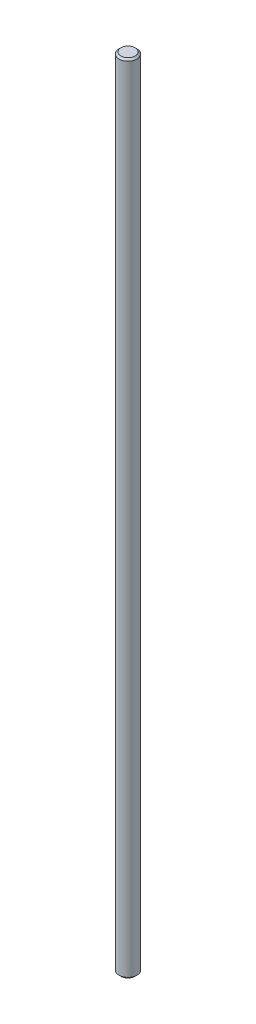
ISO-10303-21;
HEADER;
FILE_DESCRIPTION(('STEP AP214'),'2;1');
FILE_NAME('part.step','',(''),(''),'','','');
FILE_SCHEMA(('AUTOMOTIVE_DESIGN { 1 0 10303 214 1 1 1 1 }'));
ENDSEC;
DATA;
#1=APPLICATION_CONTEXT('core data for automotive mechanical design processes');
#2=APPLICATION_PROTOCOL_DEFINITION('international standard','automotive_design',2000,#1);
#3=PRODUCT_CONTEXT('',#1,'mechanical');
#4=PRODUCT('Part','Part','',(#3));
#5=PRODUCT_RELATED_PRODUCT_CATEGORY('part','',(#4));
#6=PRODUCT_DEFINITION_FORMATION('','',#4);
#7=PRODUCT_DEFINITION_CONTEXT('part definition',#1,'design');
#8=PRODUCT_DEFINITION('design','',#6,#7);
#9=PRODUCT_DEFINITION_SHAPE('','',#8);
#10=(LENGTH_UNIT() NAMED_UNIT(*) SI_UNIT(.MILLI.,.METRE.));
#11=(NAMED_UNIT(*) PLANE_ANGLE_UNIT() SI_UNIT($,.RADIAN.));
#12=(NAMED_UNIT(*) SI_UNIT($,.STERADIAN.) SOLID_ANGLE_UNIT());
#13=UNCERTAINTY_MEASURE_WITH_UNIT(LENGTH_MEASURE(1.E-05),#10,'distance_accuracy_value','');
#14=(GEOMETRIC_REPRESENTATION_CONTEXT(3) GLOBAL_UNCERTAINTY_ASSIGNED_CONTEXT((#13)) GLOBAL_UNIT_ASSIGNED_CONTEXT((#10,
#11,#12)) REPRESENTATION_CONTEXT('',''));
#15=CARTESIAN_POINT('',(0.,0.,0.));
#16=DIRECTION('',(0.,0.,1.));
#17=DIRECTION('',(1.,0.,0.));
#18=AXIS2_PLACEMENT_3D('',#15,#16,#17);
#19=CARTESIAN_POINT('',(0.,178.,0.));
#20=DIRECTION('',(0.,-1.,0.));
#21=DIRECTION('',(0.,0.,-1.));
#22=AXIS2_PLACEMENT_3D('',#19,#20,#21);
#23=CYLINDRICAL_SURFACE('',#22,2.);
#24=CARTESIAN_POINT('',(0.,0.400000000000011,0.));
#25=DIRECTION('',(0.,1.,0.));
#26=DIRECTION('',(0.,0.,1.));
#27=AXIS2_PLACEMENT_3D('',#24,#25,#26);
#28=CIRCLE('',#27,2.);
#29=CARTESIAN_POINT('',(0.,0.400000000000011,2.));
#30=VERTEX_POINT('',#29);
#31=EDGE_CURVE('E41',#30,#30,#28,.T.);
#32=ORIENTED_EDGE('',*,*,#31,.T.);
#33=EDGE_LOOP('',(#32));
#34=FACE_BOUND('',#33,.T.);
#35=CARTESIAN_POINT('',(0.,177.6,0.));
#36=DIRECTION('',(0.,1.,0.));
#37=DIRECTION('',(0.,0.,1.));
#38=AXIS2_PLACEMENT_3D('',#35,#36,#37);
#39=CIRCLE('',#38,2.);
#40=CARTESIAN_POINT('',(0.,177.6,2.));
#41=VERTEX_POINT('',#40);
#42=EDGE_CURVE('E45',#41,#41,#39,.F.);
#43=ORIENTED_EDGE('',*,*,#42,.T.);
#44=EDGE_LOOP('',(#43));
#45=FACE_BOUND('',#44,.T.);
#46=ADVANCED_FACE('F30',(#34,#45),#23,.T.);
#47=CARTESIAN_POINT('',(0.,178.,0.));
#48=DIRECTION('',(0.,1.,0.));
#49=DIRECTION('',(0.,0.,1.));
#50=AXIS2_PLACEMENT_3D('',#47,#48,#49);
#51=PLANE('',#50);
#52=CARTESIAN_POINT('',(0.,178.,0.));
#53=DIRECTION('',(0.,1.,0.));
#54=DIRECTION('',(0.,0.,1.));
#55=AXIS2_PLACEMENT_3D('',#52,#53,#54);
#56=CIRCLE('',#55,1.59999999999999);
#57=CARTESIAN_POINT('',(0.,178.,1.59999999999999));
#58=VERTEX_POINT('',#57);
#59=EDGE_CURVE('E10',#58,#58,#56,.T.);
#60=ORIENTED_EDGE('',*,*,#59,.T.);
#61=EDGE_LOOP('',(#60));
#62=FACE_BOUND('',#61,.T.);
#63=ADVANCED_FACE('F61',(#62),#51,.T.);
#64=CARTESIAN_POINT('',(0.,0.,0.));
#65=DIRECTION('',(0.,1.,0.));
#66=DIRECTION('',(0.,0.,1.));
#67=AXIS2_PLACEMENT_3D('',#64,#65,#66);
#68=PLANE('',#67);
#69=CARTESIAN_POINT('',(0.,0.,0.));
#70=DIRECTION('',(0.,1.,0.));
#71=DIRECTION('',(0.,0.,1.));
#72=AXIS2_PLACEMENT_3D('',#69,#70,#71);
#73=CIRCLE('',#72,1.59999999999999);
#74=CARTESIAN_POINT('',(0.,0.,1.59999999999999));
#75=VERTEX_POINT('',#74);
#76=EDGE_CURVE('E37',#75,#75,#73,.F.);
#77=ORIENTED_EDGE('',*,*,#76,.T.);
#78=EDGE_LOOP('',(#77));
#79=FACE_BOUND('',#78,.T.);
#80=ADVANCED_FACE('F58',(#79),#68,.F.);
#81=CARTESIAN_POINT('',(0.,0.400000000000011,0.));
#82=DIRECTION('',(0.,1.,0.));
#83=DIRECTION('',(0.,0.,1.));
#84=AXIS2_PLACEMENT_3D('',#81,#82,#83);
#85=CONICAL_SURFACE('',#84,2.,0.785398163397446);
#86=ORIENTED_EDGE('',*,*,#76,.F.);
#87=EDGE_LOOP('',(#86));
#88=FACE_BOUND('',#87,.T.);
#89=ORIENTED_EDGE('',*,*,#31,.F.);
#90=EDGE_LOOP('',(#89));
#91=FACE_BOUND('',#90,.T.);
#92=ADVANCED_FACE('F54',(#88,#91),#85,.T.);
#93=CARTESIAN_POINT('',(0.,178.,0.));
#94=DIRECTION('',(0.,-1.,0.));
#95=DIRECTION('',(0.,0.,-1.));
#96=AXIS2_PLACEMENT_3D('',#93,#94,#95);
#97=CONICAL_SURFACE('',#96,1.59999999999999,0.785398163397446);
#98=ORIENTED_EDGE('',*,*,#42,.F.);
#99=EDGE_LOOP('',(#98));
#100=FACE_BOUND('',#99,.T.);
#101=ORIENTED_EDGE('',*,*,#59,.F.);
#102=EDGE_LOOP('',(#101));
#103=FACE_BOUND('',#102,.T.);
#104=ADVANCED_FACE('F32',(#100,#103),#97,.T.);
#105=CLOSED_SHELL('',(#46,#63,#80,#92,#104));
#106=MANIFOLD_SOLID_BREP('B2',#105);
#107=ADVANCED_BREP_SHAPE_REPRESENTATION('',(#18,#106),#14);
#108=SHAPE_DEFINITION_REPRESENTATION(#9,#107);
ENDSEC;
END-ISO-10303-21;
